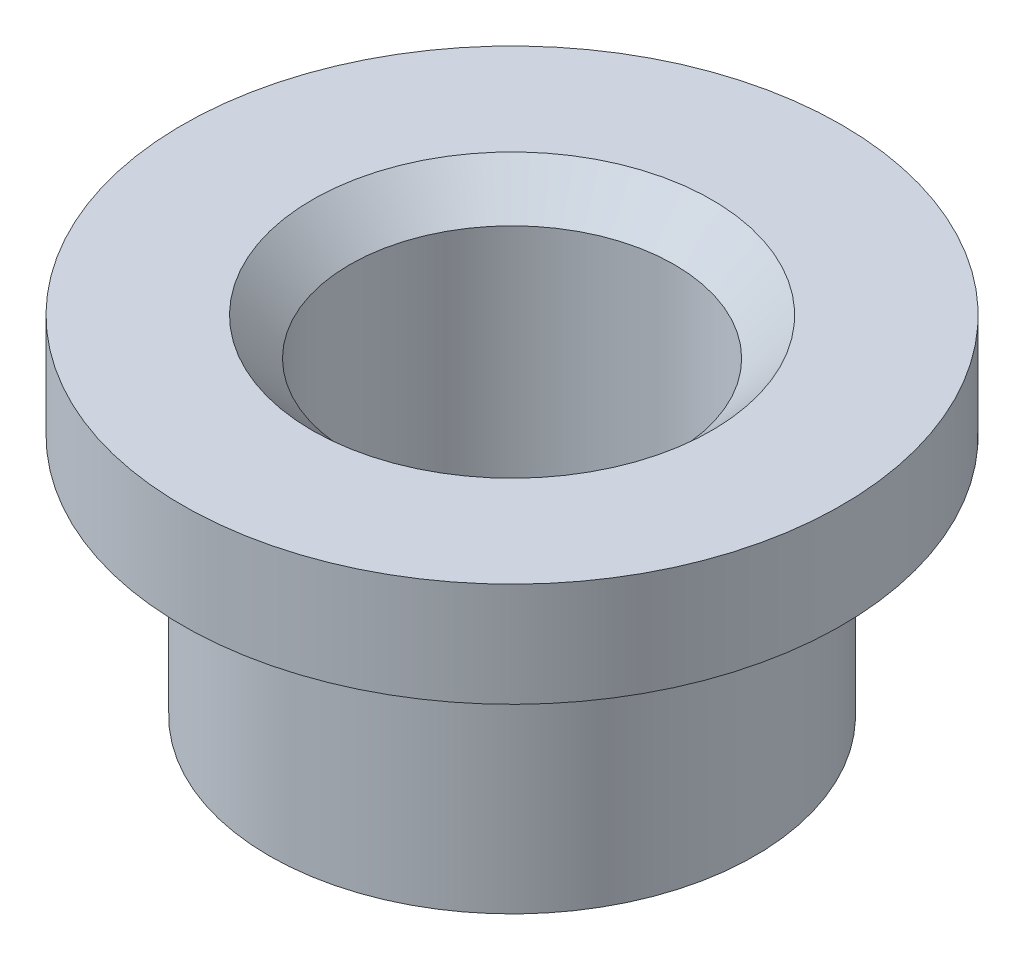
from build123d import *

# Parameters (mm, degrees)
SKETCH1_R           = 12.065
BOSS_EXTRUDE1_DEPTH = 3.81
SKETCH2_R           = 8.89
BOSS_EXTRUDE2_DEPTH = 8.89


with BuildPart() as part:
    # Sketch1 → Boss-Extrude1 (new body)
    with BuildSketch(Plane(origin=(0, 0, 0), x_dir=(1, 0, 0), z_dir=(0, 1, 0))):
        with Locations(Location((0, 0, 0), (0, 0, 90))):
            Circle(SKETCH1_R)
    extrude(amount=BOSS_EXTRUDE1_DEPTH)

    # Sketch2 → Boss-Extrude2 (add)
    with BuildSketch(Plane.XZ):
        with Locations(Location((0, 0, 0), (0, 0, 270))):
            Circle(SKETCH2_R)
    extrude(amount=BOSS_EXTRUDE2_DEPTH)

    # Sketch3 → 1_4-18 NPSM Tapped Hole1 (revolve, cut)
    with BuildSketch(Plane(origin=(0, 3.81, 0), x_dir=(0, 0, 1), z_dir=(1, 0, 0))):
        Polygon((0, 0), (0, 12.7), (5.9436, 12.7), (5.9436, 1.3716), (7.3152, 0), align=None)
    revolve(axis=Axis((0, 10.16, 0), (0, -1, 0)), mode=Mode.SUBTRACT)


solid = part.part
